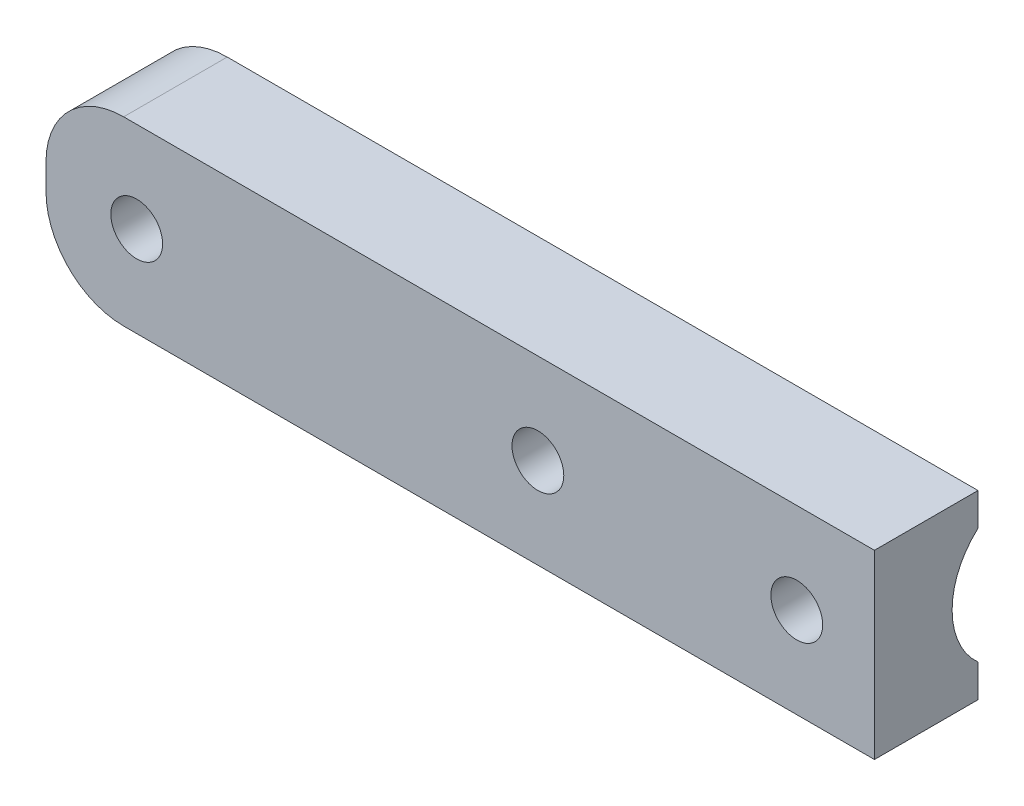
from build123d import *

# Parameters (mm, degrees)
SKETCH1_W           = 101.6
SKETCH1_H           = 22.225
SKETCH1_R           = 3.175
BOSS_EXTRUDE1_DEPTH = 6.35
FILLET1_R           = 9.525
SKETCH2_R           = 9.525
CUT_EXTRUDE1_DEPTH  = 50.8
CUT_EXTRUDE2_START  = -2.54
SKETCH3_R           = 9.525
CUT_EXTRUDE2_DEPTH  = 50.8


with BuildPart() as part:
    # Sketch1 → Boss-Extrude1 (new, symmetric)
    with BuildSketch(Plane.XY):
        with Locations((39.6748, 0)):
            Rectangle(SKETCH1_W, SKETCH1_H)
        Circle(SKETCH1_R, mode=Mode.SUBTRACT)
        with Locations((80.9498, 0)):
            Circle(SKETCH1_R, mode=Mode.SUBTRACT)
        with Locations((49.1998, 0)):
            Circle(SKETCH1_R, mode=Mode.SUBTRACT)
    extrude(amount=BOSS_EXTRUDE1_DEPTH, both=True)

    # Fillet1
    fillet1_edges = [part.edges().sort_by_distance(p)[0] for p in [
        (-11.1252, 11.1125, 0),
        (-11.1252, -11.1125, 0),
    ]]
    fillet(fillet1_edges, radius=FILLET1_R)

    # Sketch2 → Cut-Extrude1 (cut)
    with BuildSketch(Plane(origin=(90.4748, 0, 0), x_dir=(0, 0, -1), z_dir=(1, 0, 0))):
        with Locations((12.7, 0)):
            Circle(SKETCH2_R)
    extrude(amount=-CUT_EXTRUDE1_DEPTH, mode=Mode.SUBTRACT)

    # Sketch3 → Cut-Extrude2 (cut)
    with BuildSketch(Plane.XY.offset(CUT_EXTRUDE2_START)):
        Circle(SKETCH3_R)
    extrude(amount=-CUT_EXTRUDE2_DEPTH, mode=Mode.SUBTRACT)


solid = part.part
